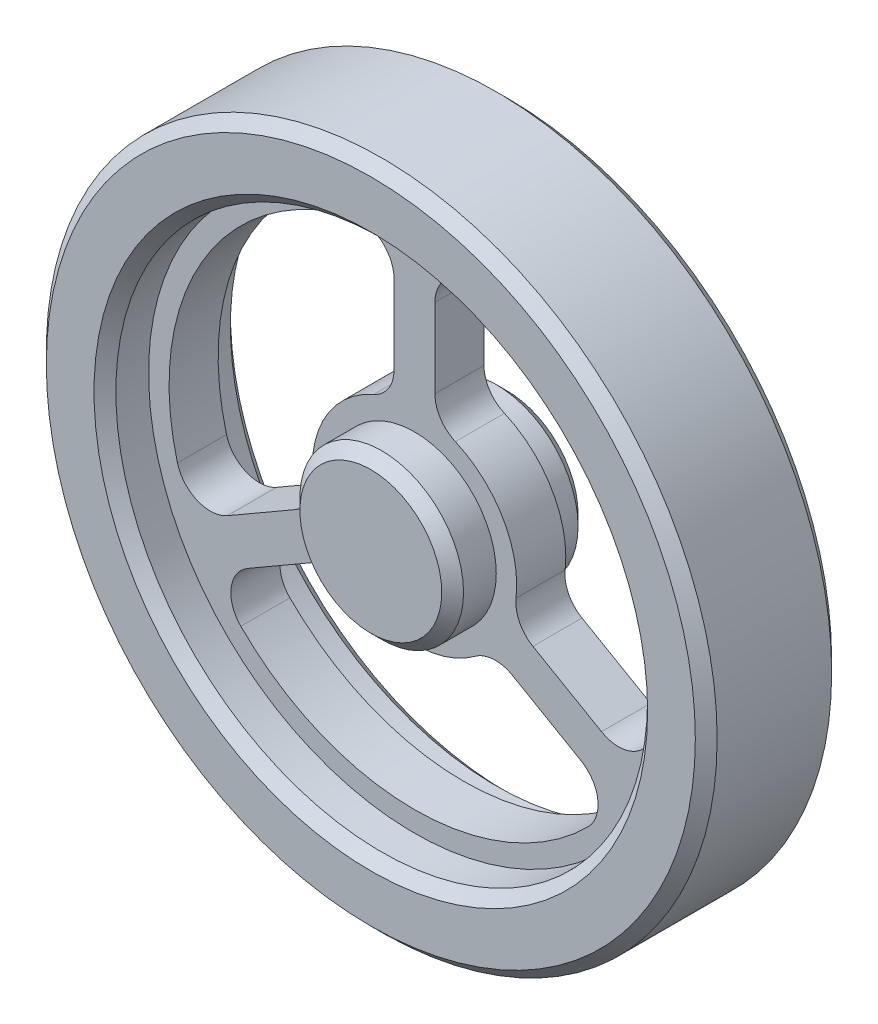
ISO-10303-21;
HEADER;
FILE_DESCRIPTION(('STEP AP214'),'2;1');
FILE_NAME('part.step','',(''),(''),'','','');
FILE_SCHEMA(('AUTOMOTIVE_DESIGN { 1 0 10303 214 1 1 1 1 }'));
ENDSEC;
DATA;
#1=APPLICATION_CONTEXT('core data for automotive mechanical design processes');
#2=APPLICATION_PROTOCOL_DEFINITION('international standard','automotive_design',2000,#1);
#3=PRODUCT_CONTEXT('',#1,'mechanical');
#4=PRODUCT('Part','Part','',(#3));
#5=PRODUCT_RELATED_PRODUCT_CATEGORY('part','',(#4));
#6=PRODUCT_DEFINITION_FORMATION('','',#4);
#7=PRODUCT_DEFINITION_CONTEXT('part definition',#1,'design');
#8=PRODUCT_DEFINITION('design','',#6,#7);
#9=PRODUCT_DEFINITION_SHAPE('','',#8);
#10=(LENGTH_UNIT() NAMED_UNIT(*) SI_UNIT(.MILLI.,.METRE.));
#11=(NAMED_UNIT(*) PLANE_ANGLE_UNIT() SI_UNIT($,.RADIAN.));
#12=(NAMED_UNIT(*) SI_UNIT($,.STERADIAN.) SOLID_ANGLE_UNIT());
#13=UNCERTAINTY_MEASURE_WITH_UNIT(LENGTH_MEASURE(1.E-05),#10,'distance_accuracy_value','');
#14=(GEOMETRIC_REPRESENTATION_CONTEXT(3) GLOBAL_UNCERTAINTY_ASSIGNED_CONTEXT((#13)) GLOBAL_UNIT_ASSIGNED_CONTEXT((#10,
#11,#12)) REPRESENTATION_CONTEXT('',''));
#15=CARTESIAN_POINT('',(0.,0.,0.));
#16=DIRECTION('',(0.,0.,1.));
#17=DIRECTION('',(1.,0.,0.));
#18=AXIS2_PLACEMENT_3D('',#15,#16,#17);
#19=CARTESIAN_POINT('',(0.,0.,-5.));
#20=DIRECTION('',(0.,0.,1.));
#21=DIRECTION('',(1.,0.,0.));
#22=AXIS2_PLACEMENT_3D('',#19,#20,#21);
#23=PLANE('',#22);
#24=CARTESIAN_POINT('',(0.,0.,-5.));
#25=DIRECTION('',(0.,0.,1.));
#26=DIRECTION('',(1.,0.,0.));
#27=AXIS2_PLACEMENT_3D('',#24,#25,#26);
#28=CIRCLE('',#27,5.2);
#29=CARTESIAN_POINT('',(5.2,0.,-5.));
#30=VERTEX_POINT('',#29);
#31=EDGE_CURVE('E410',#30,#30,#28,.F.);
#32=ORIENTED_EDGE('',*,*,#31,.T.);
#33=EDGE_LOOP('',(#32));
#34=FACE_BOUND('',#33,.T.);
#35=CARTESIAN_POINT('',(0.,0.,-5.));
#36=DIRECTION('',(0.,0.,1.));
#37=DIRECTION('',(1.,0.,0.));
#38=AXIS2_PLACEMENT_3D('',#35,#36,#37);
#39=CIRCLE('',#38,3.);
#40=CARTESIAN_POINT('',(3.,0.,-5.));
#41=VERTEX_POINT('',#40);
#42=EDGE_CURVE('E404',#41,#41,#39,.F.);
#43=ORIENTED_EDGE('',*,*,#42,.F.);
#44=EDGE_LOOP('',(#43));
#45=FACE_BOUND('',#44,.T.);
#46=ADVANCED_FACE('F48',(#34,#45),#23,.F.);
#47=CARTESIAN_POINT('',(0.,0.,-5.));
#48=DIRECTION('',(0.,0.,1.));
#49=DIRECTION('',(1.,0.,0.));
#50=AXIS2_PLACEMENT_3D('',#47,#48,#49);
#51=CYLINDRICAL_SURFACE('',#50,18.);
#52=CARTESIAN_POINT('',(0.,0.,1.8));
#53=DIRECTION('',(0.,0.,1.));
#54=DIRECTION('',(1.,0.,0.));
#55=AXIS2_PLACEMENT_3D('',#52,#53,#54);
#56=CIRCLE('',#55,18.);
#57=CARTESIAN_POINT('',(-4.64516129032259,17.39029834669,1.8));
#58=VERTEX_POINT('',#57);
#59=CARTESIAN_POINT('',(-17.3830207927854,-4.67232149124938,1.8));
#60=VERTEX_POINT('',#59);
#61=EDGE_CURVE('E292',#58,#60,#56,.T.);
#62=ORIENTED_EDGE('',*,*,#61,.T.);
#63=DIRECTION('',(0.,0.,1.));
#64=VECTOR('',#63,1.);
#65=CARTESIAN_POINT('',(-17.3830207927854,-4.67232149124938,-5.));
#66=LINE('',#65,#64);
#67=CARTESIAN_POINT('',(-17.3830207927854,-4.67232149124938,-1.8));
#68=VERTEX_POINT('',#67);
#69=EDGE_CURVE('E63',#60,#68,#66,.F.);
#70=ORIENTED_EDGE('',*,*,#69,.T.);
#71=CARTESIAN_POINT('',(0.,0.,-1.8));
#72=DIRECTION('',(0.,0.,-1.));
#73=DIRECTION('',(-1.,0.,0.));
#74=AXIS2_PLACEMENT_3D('',#71,#72,#73);
#75=CIRCLE('',#74,18.);
#76=CARTESIAN_POINT('',(-4.64516129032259,17.39029834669,-1.8));
#77=VERTEX_POINT('',#76);
#78=EDGE_CURVE('E285',#68,#77,#75,.T.);
#79=ORIENTED_EDGE('',*,*,#78,.T.);
#80=DIRECTION('',(0.,0.,1.));
#81=VECTOR('',#80,1.);
#82=CARTESIAN_POINT('',(-4.64516129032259,17.39029834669,-5.));
#83=LINE('',#82,#81);
#84=EDGE_CURVE('E312',#77,#58,#83,.T.);
#85=ORIENTED_EDGE('',*,*,#84,.T.);
#86=EDGE_LOOP('',(#62,#70,#79,#85));
#87=FACE_BOUND('',#86,.T.);
#88=ADVANCED_FACE('F451',(#87),#51,.F.);
#89=CARTESIAN_POINT('',(0.,0.,-5.));
#90=DIRECTION('',(0.,0.,1.));
#91=DIRECTION('',(1.,0.,0.));
#92=AXIS2_PLACEMENT_3D('',#89,#90,#91);
#93=CYLINDRICAL_SURFACE('',#92,7.5);
#94=CARTESIAN_POINT('',(0.,0.,-1.8));
#95=DIRECTION('',(0.,0.,-1.));
#96=DIRECTION('',(-1.,0.,0.));
#97=AXIS2_PLACEMENT_3D('',#94,#95,#96);
#98=CIRCLE('',#97,7.5);
#99=CARTESIAN_POINT('',(-7.45294044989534,-0.838855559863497,-1.8));
#100=VERTEX_POINT('',#99);
#101=CARTESIAN_POINT('',(-3.,6.87386354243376,-1.8));
#102=VERTEX_POINT('',#101);
#103=EDGE_CURVE('E251',#100,#102,#98,.T.);
#104=ORIENTED_EDGE('',*,*,#103,.F.);
#105=DIRECTION('',(0.,0.,1.));
#106=VECTOR('',#105,1.);
#107=CARTESIAN_POINT('',(-7.45294044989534,-0.838855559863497,-5.));
#108=LINE('',#107,#106);
#109=CARTESIAN_POINT('',(-7.45294044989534,-0.838855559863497,1.8));
#110=VERTEX_POINT('',#109);
#111=EDGE_CURVE('E370',#100,#110,#108,.T.);
#112=ORIENTED_EDGE('',*,*,#111,.T.);
#113=CARTESIAN_POINT('',(0.,0.,1.8));
#114=DIRECTION('',(0.,0.,1.));
#115=DIRECTION('',(1.,0.,0.));
#116=AXIS2_PLACEMENT_3D('',#113,#114,#115);
#117=CIRCLE('',#116,7.5);
#118=CARTESIAN_POINT('',(-3.,6.87386354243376,1.8));
#119=VERTEX_POINT('',#118);
#120=EDGE_CURVE('E252',#119,#110,#117,.T.);
#121=ORIENTED_EDGE('',*,*,#120,.F.);
#122=DIRECTION('',(0.,0.,1.));
#123=VECTOR('',#122,1.);
#124=CARTESIAN_POINT('',(-3.,6.87386354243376,-5.));
#125=LINE('',#124,#123);
#126=EDGE_CURVE('E283',#119,#102,#125,.F.);
#127=ORIENTED_EDGE('',*,*,#126,.T.);
#128=EDGE_LOOP('',(#104,#112,#121,#127));
#129=FACE_BOUND('',#128,.T.);
#130=ADVANCED_FACE('F457',(#129),#93,.T.);
#131=CARTESIAN_POINT('',(12.7378595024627,-12.7179768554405,-1.8));
#132=VERTEX_POINT('',#131);
#133=CARTESIAN_POINT('',(-12.7378595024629,-12.7179768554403,-1.8));
#134=VERTEX_POINT('',#133);
#135=EDGE_CURVE('E284',#132,#134,#75,.T.);
#136=ORIENTED_EDGE('',*,*,#135,.T.);
#137=DIRECTION('',(0.,0.,1.));
#138=VECTOR('',#137,1.);
#139=CARTESIAN_POINT('',(-12.7378595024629,-12.7179768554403,-5.));
#140=LINE('',#139,#138);
#141=CARTESIAN_POINT('',(-12.7378595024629,-12.7179768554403,1.8));
#142=VERTEX_POINT('',#141);
#143=EDGE_CURVE('E385',#134,#142,#140,.T.);
#144=ORIENTED_EDGE('',*,*,#143,.T.);
#145=CARTESIAN_POINT('',(12.7378595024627,-12.7179768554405,1.8));
#146=VERTEX_POINT('',#145);
#147=EDGE_CURVE('E294',#142,#146,#56,.T.);
#148=ORIENTED_EDGE('',*,*,#147,.T.);
#149=DIRECTION('',(0.,0.,1.));
#150=VECTOR('',#149,1.);
#151=CARTESIAN_POINT('',(12.7378595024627,-12.7179768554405,-5.));
#152=LINE('',#151,#150);
#153=EDGE_CURVE('E351',#146,#132,#152,.F.);
#154=ORIENTED_EDGE('',*,*,#153,.T.);
#155=EDGE_LOOP('',(#136,#144,#148,#154));
#156=FACE_BOUND('',#155,.T.);
#157=ADVANCED_FACE('F459',(#156),#51,.F.);
#158=CARTESIAN_POINT('',(-4.45294044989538,-6.03500798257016,1.8));
#159=VERTEX_POINT('',#158);
#160=CARTESIAN_POINT('',(4.4529404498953,-6.03500798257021,1.8));
#161=VERTEX_POINT('',#160);
#162=EDGE_CURVE('E256',#159,#161,#117,.T.);
#163=ORIENTED_EDGE('',*,*,#162,.F.);
#164=DIRECTION('',(0.,0.,1.));
#165=VECTOR('',#164,1.);
#166=CARTESIAN_POINT('',(-4.45294044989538,-6.03500798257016,-5.));
#167=LINE('',#166,#165);
#168=CARTESIAN_POINT('',(-4.45294044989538,-6.03500798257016,-1.8));
#169=VERTEX_POINT('',#168);
#170=EDGE_CURVE('E383',#159,#169,#167,.F.);
#171=ORIENTED_EDGE('',*,*,#170,.T.);
#172=CARTESIAN_POINT('',(4.4529404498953,-6.03500798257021,-1.8));
#173=VERTEX_POINT('',#172);
#174=EDGE_CURVE('E267',#173,#169,#98,.T.);
#175=ORIENTED_EDGE('',*,*,#174,.F.);
#176=DIRECTION('',(0.,0.,1.));
#177=VECTOR('',#176,1.);
#178=CARTESIAN_POINT('',(4.4529404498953,-6.03500798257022,-5.));
#179=LINE('',#178,#177);
#180=EDGE_CURVE('E333',#173,#161,#179,.T.);
#181=ORIENTED_EDGE('',*,*,#180,.T.);
#182=EDGE_LOOP('',(#163,#171,#175,#181));
#183=FACE_BOUND('',#182,.T.);
#184=ADVANCED_FACE('F494',(#183),#93,.T.);
#185=CARTESIAN_POINT('',(0.,0.,-5.));
#186=DIRECTION('',(0.,0.,1.));
#187=DIRECTION('',(1.,0.,0.));
#188=AXIS2_PLACEMENT_3D('',#185,#186,#187);
#189=PLANE('',#188);
#190=CARTESIAN_POINT('',(0.,0.,-5.));
#191=DIRECTION('',(0.,0.,1.));
#192=DIRECTION('',(1.,0.,0.));
#193=AXIS2_PLACEMENT_3D('',#190,#191,#192);
#194=CIRCLE('',#193,23.8);
#195=CARTESIAN_POINT('',(23.8,0.,-5.));
#196=VERTEX_POINT('',#195);
#197=EDGE_CURVE('E428',#196,#196,#194,.F.);
#198=ORIENTED_EDGE('',*,*,#197,.T.);
#199=EDGE_LOOP('',(#198));
#200=FACE_BOUND('',#199,.T.);
#201=CARTESIAN_POINT('',(0.,0.,-5.));
#202=DIRECTION('',(0.,0.,1.));
#203=DIRECTION('',(1.,0.,0.));
#204=AXIS2_PLACEMENT_3D('',#201,#202,#203);
#205=CIRCLE('',#204,20.3);
#206=CARTESIAN_POINT('',(20.3,0.,-5.));
#207=VERTEX_POINT('',#206);
#208=EDGE_CURVE('E425',#207,#207,#205,.T.);
#209=ORIENTED_EDGE('',*,*,#208,.T.);
#210=EDGE_LOOP('',(#209));
#211=FACE_BOUND('',#210,.T.);
#212=ADVANCED_FACE('F478',(#200,#211),#189,.F.);
#213=CARTESIAN_POINT('',(0.,0.,5.));
#214=DIRECTION('',(0.,0.,-1.));
#215=DIRECTION('',(-1.,0.,0.));
#216=AXIS2_PLACEMENT_3D('',#213,#214,#215);
#217=CYLINDRICAL_SURFACE('',#216,24.6);
#218=CARTESIAN_POINT('',(0.,0.,-4.20000000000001));
#219=DIRECTION('',(0.,0.,1.));
#220=DIRECTION('',(1.,0.,0.));
#221=AXIS2_PLACEMENT_3D('',#218,#219,#220);
#222=CIRCLE('',#221,24.6);
#223=CARTESIAN_POINT('',(24.6,0.,-4.20000000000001));
#224=VERTEX_POINT('',#223);
#225=EDGE_CURVE('E422',#224,#224,#222,.T.);
#226=ORIENTED_EDGE('',*,*,#225,.T.);
#227=EDGE_LOOP('',(#226));
#228=FACE_BOUND('',#227,.T.);
#229=CARTESIAN_POINT('',(0.,0.,4.20000000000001));
#230=DIRECTION('',(0.,0.,1.));
#231=DIRECTION('',(1.,0.,0.));
#232=AXIS2_PLACEMENT_3D('',#229,#230,#231);
#233=CIRCLE('',#232,24.6);
#234=CARTESIAN_POINT('',(24.6,0.,4.20000000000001));
#235=VERTEX_POINT('',#234);
#236=EDGE_CURVE('E419',#235,#235,#233,.F.);
#237=ORIENTED_EDGE('',*,*,#236,.T.);
#238=EDGE_LOOP('',(#237));
#239=FACE_BOUND('',#238,.T.);
#240=ADVANCED_FACE('F475',(#228,#239),#217,.T.);
#241=CARTESIAN_POINT('',(0.,0.,5.));
#242=DIRECTION('',(0.,0.,1.));
#243=DIRECTION('',(1.,0.,0.));
#244=AXIS2_PLACEMENT_3D('',#241,#242,#243);
#245=PLANE('',#244);
#246=CARTESIAN_POINT('',(0.,0.,5.));
#247=DIRECTION('',(0.,0.,1.));
#248=DIRECTION('',(1.,0.,0.));
#249=AXIS2_PLACEMENT_3D('',#246,#247,#248);
#250=CIRCLE('',#249,20.3);
#251=CARTESIAN_POINT('',(20.3,0.,5.));
#252=VERTEX_POINT('',#251);
#253=EDGE_CURVE('E12',#252,#252,#250,.F.);
#254=ORIENTED_EDGE('',*,*,#253,.T.);
#255=EDGE_LOOP('',(#254));
#256=FACE_BOUND('',#255,.T.);
#257=CARTESIAN_POINT('',(0.,0.,5.));
#258=DIRECTION('',(0.,0.,1.));
#259=DIRECTION('',(1.,0.,0.));
#260=AXIS2_PLACEMENT_3D('',#257,#258,#259);
#261=CIRCLE('',#260,23.8);
#262=CARTESIAN_POINT('',(23.8,0.,5.));
#263=VERTEX_POINT('',#262);
#264=EDGE_CURVE('E56',#263,#263,#261,.T.);
#265=ORIENTED_EDGE('',*,*,#264,.T.);
#266=EDGE_LOOP('',(#265));
#267=FACE_BOUND('',#266,.T.);
#268=ADVANCED_FACE('F439',(#256,#267),#245,.T.);
#269=CARTESIAN_POINT('',(0.,0.,1.8));
#270=DIRECTION('',(0.,0.,1.));
#271=DIRECTION('',(1.,0.,0.));
#272=AXIS2_PLACEMENT_3D('',#269,#270,#271);
#273=CYLINDRICAL_SURFACE('',#272,19.5);
#274=CARTESIAN_POINT('',(0.,0.,4.2));
#275=DIRECTION('',(0.,0.,1.));
#276=DIRECTION('',(1.,0.,0.));
#277=AXIS2_PLACEMENT_3D('',#274,#275,#276);
#278=CIRCLE('',#277,19.5);
#279=CARTESIAN_POINT('',(19.5,0.,4.2));
#280=VERTEX_POINT('',#279);
#281=EDGE_CURVE('E434',#280,#280,#278,.T.);
#282=ORIENTED_EDGE('',*,*,#281,.T.);
#283=EDGE_LOOP('',(#282));
#284=FACE_BOUND('',#283,.T.);
#285=CARTESIAN_POINT('',(0.,0.,1.8));
#286=DIRECTION('',(0.,0.,1.));
#287=DIRECTION('',(1.,0.,0.));
#288=AXIS2_PLACEMENT_3D('',#285,#286,#287);
#289=CIRCLE('',#288,19.5);
#290=CARTESIAN_POINT('',(19.5,0.,1.8));
#291=VERTEX_POINT('',#290);
#292=EDGE_CURVE('E279',#291,#291,#289,.T.);
#293=ORIENTED_EDGE('',*,*,#292,.F.);
#294=EDGE_LOOP('',(#293));
#295=FACE_BOUND('',#294,.T.);
#296=ADVANCED_FACE('F480',(#284,#295),#273,.F.);
#297=CARTESIAN_POINT('',(0.,0.,1.8));
#298=DIRECTION('',(0.,0.,1.));
#299=DIRECTION('',(1.,0.,0.));
#300=AXIS2_PLACEMENT_3D('',#297,#298,#299);
#301=PLANE('',#300);
#302=ORIENTED_EDGE('',*,*,#147,.F.);
#303=CARTESIAN_POINT('',(-10.968712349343,-10.9515911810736,1.8));
#304=DIRECTION('',(0.,0.,1.));
#305=DIRECTION('',(1.,0.,0.));
#306=AXIS2_PLACEMENT_3D('',#303,#304,#305);
#307=CIRCLE('',#306,2.5);
#308=CARTESIAN_POINT('',(-12.218712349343,-8.78652767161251,1.8));
#309=VERTEX_POINT('',#308);
#310=EDGE_CURVE('E397',#142,#309,#307,.F.);
#311=ORIENTED_EDGE('',*,*,#310,.T.);
#312=DIRECTION('',(0.866025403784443,0.499999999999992,0.));
#313=VECTOR('',#312,1.);
#314=CARTESIAN_POINT('',(-5.61396103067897,-4.97327271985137,1.8));
#315=LINE('',#314,#313);
#316=CARTESIAN_POINT('',(-7.18725393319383,-5.88161380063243,1.8));
#317=VERTEX_POINT('',#316);
#318=EDGE_CURVE('E229',#309,#317,#315,.T.);
#319=ORIENTED_EDGE('',*,*,#318,.T.);
#320=CARTESIAN_POINT('',(-5.93725393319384,-8.04667731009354,1.8));
#321=DIRECTION('',(0.,0.,1.));
#322=DIRECTION('',(1.,0.,0.));
#323=AXIS2_PLACEMENT_3D('',#320,#321,#322);
#324=CIRCLE('',#323,2.5);
#325=EDGE_CURVE('E393',#317,#159,#324,.F.);
#326=ORIENTED_EDGE('',*,*,#325,.T.);
#327=ORIENTED_EDGE('',*,*,#162,.T.);
#328=CARTESIAN_POINT('',(5.93725393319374,-8.04667731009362,1.8));
#329=DIRECTION('',(0.,0.,1.));
#330=DIRECTION('',(1.,0.,0.));
#331=AXIS2_PLACEMENT_3D('',#328,#329,#330);
#332=CIRCLE('',#331,2.5);
#333=CARTESIAN_POINT('',(7.18725393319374,-5.88161380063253,1.8));
#334=VERTEX_POINT('',#333);
#335=EDGE_CURVE('E353',#161,#334,#332,.F.);
#336=ORIENTED_EDGE('',*,*,#335,.T.);
#337=DIRECTION('',(0.866025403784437,-0.500000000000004,0.));
#338=VECTOR('',#337,1.);
#339=CARTESIAN_POINT('',(14.7842363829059,-10.2677336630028,1.8));
#340=LINE('',#339,#338);
#341=CARTESIAN_POINT('',(12.2187123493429,-8.78652767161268,1.8));
#342=VERTEX_POINT('',#341);
#343=EDGE_CURVE('E239',#334,#342,#340,.T.);
#344=ORIENTED_EDGE('',*,*,#343,.T.);
#345=CARTESIAN_POINT('',(10.9687123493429,-10.9515911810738,1.8));
#346=DIRECTION('',(0.,0.,1.));
#347=DIRECTION('',(1.,0.,0.));
#348=AXIS2_PLACEMENT_3D('',#345,#346,#347);
#349=CIRCLE('',#348,2.5);
#350=EDGE_CURVE('E365',#342,#146,#349,.F.);
#351=ORIENTED_EDGE('',*,*,#350,.T.);
#352=EDGE_LOOP('',(#302,#311,#319,#326,#327,#336,#344,#351));
#353=FACE_BOUND('',#352,.T.);
#354=CARTESIAN_POINT('',(17.3830207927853,-4.67232149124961,1.8));
#355=VERTEX_POINT('',#354);
#356=CARTESIAN_POINT('',(4.64516129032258,17.39029834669,1.8));
#357=VERTEX_POINT('',#356);
#358=EDGE_CURVE('E291',#355,#357,#56,.T.);
#359=ORIENTED_EDGE('',*,*,#358,.F.);
#360=CARTESIAN_POINT('',(14.9687123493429,-4.02338795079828,1.8));
#361=DIRECTION('',(0.,0.,1.));
#362=DIRECTION('',(1.,0.,0.));
#363=AXIS2_PLACEMENT_3D('',#360,#361,#362);
#364=CIRCLE('',#363,2.5);
#365=CARTESIAN_POINT('',(13.7187123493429,-6.18845146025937,1.8));
#366=VERTEX_POINT('',#365);
#367=EDGE_CURVE('E361',#355,#366,#364,.F.);
#368=ORIENTED_EDGE('',*,*,#367,.T.);
#369=DIRECTION('',(-0.866025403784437,0.500000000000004,0.));
#370=VECTOR('',#369,1.);
#371=CARTESIAN_POINT('',(7.11396103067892,-2.37519650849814,1.8));
#372=LINE('',#371,#370);
#373=CARTESIAN_POINT('',(8.68725393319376,-3.28353758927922,1.8));
#374=VERTEX_POINT('',#373);
#375=EDGE_CURVE('E240',#366,#374,#372,.T.);
#376=ORIENTED_EDGE('',*,*,#375,.T.);
#377=CARTESIAN_POINT('',(9.93725393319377,-1.11847407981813,1.8));
#378=DIRECTION('',(0.,0.,1.));
#379=DIRECTION('',(1.,0.,0.));
#380=AXIS2_PLACEMENT_3D('',#377,#378,#379);
#381=CIRCLE('',#380,2.5);
#382=CARTESIAN_POINT('',(7.45294044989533,-0.838855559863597,1.8));
#383=VERTEX_POINT('',#382);
#384=EDGE_CURVE('E357',#374,#383,#381,.F.);
#385=ORIENTED_EDGE('',*,*,#384,.T.);
#386=CARTESIAN_POINT('',(3.,6.87386354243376,1.8));
#387=VERTEX_POINT('',#386);
#388=EDGE_CURVE('E257',#383,#387,#117,.T.);
#389=ORIENTED_EDGE('',*,*,#388,.T.);
#390=CARTESIAN_POINT('',(4.,9.16515138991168,1.8));
#391=DIRECTION('',(0.,0.,1.));
#392=DIRECTION('',(1.,0.,0.));
#393=AXIS2_PLACEMENT_3D('',#390,#391,#392);
#394=CIRCLE('',#393,2.5);
#395=CARTESIAN_POINT('',(1.5,9.16515138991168,1.8));
#396=VERTEX_POINT('',#395);
#397=EDGE_CURVE('E315',#387,#396,#394,.F.);
#398=ORIENTED_EDGE('',*,*,#397,.T.);
#399=DIRECTION('',(0.,1.,0.));
#400=VECTOR('',#399,1.);
#401=CARTESIAN_POINT('',(1.5,17.9373911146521,1.8));
#402=LINE('',#401,#400);
#403=CARTESIAN_POINT('',(1.5,14.9749791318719,1.8));
#404=VERTEX_POINT('',#403);
#405=EDGE_CURVE('E263',#396,#404,#402,.T.);
#406=ORIENTED_EDGE('',*,*,#405,.T.);
#407=CARTESIAN_POINT('',(4.,14.9749791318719,1.8));
#408=DIRECTION('',(0.,0.,1.));
#409=DIRECTION('',(1.,0.,0.));
#410=AXIS2_PLACEMENT_3D('',#407,#408,#409);
#411=CIRCLE('',#410,2.5);
#412=EDGE_CURVE('E328',#404,#357,#411,.F.);
#413=ORIENTED_EDGE('',*,*,#412,.T.);
#414=EDGE_LOOP('',(#359,#368,#376,#385,#389,#398,#406,#413));
#415=FACE_BOUND('',#414,.T.);
#416=ORIENTED_EDGE('',*,*,#61,.F.);
#417=CARTESIAN_POINT('',(-4.,14.9749791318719,1.8));
#418=DIRECTION('',(0.,0.,1.));
#419=DIRECTION('',(1.,0.,0.));
#420=AXIS2_PLACEMENT_3D('',#417,#418,#419);
#421=CIRCLE('',#420,2.5);
#422=CARTESIAN_POINT('',(-1.5,14.9749791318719,1.8));
#423=VERTEX_POINT('',#422);
#424=EDGE_CURVE('E323',#58,#423,#421,.F.);
#425=ORIENTED_EDGE('',*,*,#424,.T.);
#426=DIRECTION('',(0.,-1.,0.));
#427=VECTOR('',#426,1.);
#428=CARTESIAN_POINT('',(-1.5,7.34846922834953,1.8));
#429=LINE('',#428,#427);
#430=CARTESIAN_POINT('',(-1.5,9.16515138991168,1.8));
#431=VERTEX_POINT('',#430);
#432=EDGE_CURVE('E268',#423,#431,#429,.T.);
#433=ORIENTED_EDGE('',*,*,#432,.T.);
#434=CARTESIAN_POINT('',(-4.,9.16515138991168,1.8));
#435=DIRECTION('',(0.,0.,1.));
#436=DIRECTION('',(1.,0.,0.));
#437=AXIS2_PLACEMENT_3D('',#434,#435,#436);
#438=CIRCLE('',#437,2.5);
#439=EDGE_CURVE('E319',#431,#119,#438,.F.);
#440=ORIENTED_EDGE('',*,*,#439,.T.);
#441=ORIENTED_EDGE('',*,*,#120,.T.);
#442=CARTESIAN_POINT('',(-9.93725393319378,-1.118474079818,1.8));
#443=DIRECTION('',(0.,0.,1.));
#444=DIRECTION('',(1.,0.,0.));
#445=AXIS2_PLACEMENT_3D('',#442,#443,#444);
#446=CIRCLE('',#445,2.5);
#447=CARTESIAN_POINT('',(-8.68725393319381,-3.28353758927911,1.8));
#448=VERTEX_POINT('',#447);
#449=EDGE_CURVE('E389',#110,#448,#446,.F.);
#450=ORIENTED_EDGE('',*,*,#449,.T.);
#451=DIRECTION('',(-0.866025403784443,-0.499999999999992,0.));
#452=VECTOR('',#451,1.);
#453=CARTESIAN_POINT('',(-16.2842363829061,-7.66965745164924,1.8));
#454=LINE('',#453,#452);
#455=CARTESIAN_POINT('',(-13.718712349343,-6.18845146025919,1.8));
#456=VERTEX_POINT('',#455);
#457=EDGE_CURVE('E224',#448,#456,#454,.T.);
#458=ORIENTED_EDGE('',*,*,#457,.T.);
#459=CARTESIAN_POINT('',(-14.968712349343,-4.02338795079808,1.8));
#460=DIRECTION('',(0.,0.,1.));
#461=DIRECTION('',(1.,0.,0.));
#462=AXIS2_PLACEMENT_3D('',#459,#460,#461);
#463=CIRCLE('',#462,2.5);
#464=EDGE_CURVE('E71',#456,#60,#463,.F.);
#465=ORIENTED_EDGE('',*,*,#464,.T.);
#466=EDGE_LOOP('',(#416,#425,#433,#440,#441,#450,#458,#465));
#467=FACE_BOUND('',#466,.T.);
#468=ORIENTED_EDGE('',*,*,#292,.T.);
#469=EDGE_LOOP('',(#468));
#470=FACE_BOUND('',#469,.T.);
#471=CARTESIAN_POINT('',(0.,0.,1.8));
#472=DIRECTION('',(0.,0.,1.));
#473=DIRECTION('',(1.,0.,0.));
#474=AXIS2_PLACEMENT_3D('',#471,#472,#473);
#475=CIRCLE('',#474,6.);
#476=CARTESIAN_POINT('',(6.,0.,1.8));
#477=VERTEX_POINT('',#476);
#478=EDGE_CURVE('E260',#477,#477,#475,.T.);
#479=ORIENTED_EDGE('',*,*,#478,.F.);
#480=EDGE_LOOP('',(#479));
#481=FACE_BOUND('',#480,.T.);
#482=ADVANCED_FACE('F483',(#353,#415,#467,#470,#481),#301,.T.);
#483=CARTESIAN_POINT('',(0.,0.,-1.8));
#484=DIRECTION('',(0.,0.,-1.));
#485=DIRECTION('',(1.,0.,0.));
#486=AXIS2_PLACEMENT_3D('',#483,#484,#485);
#487=PLANE('',#486);
#488=DIRECTION('',(0.866025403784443,0.499999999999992,0.));
#489=VECTOR('',#488,1.);
#490=CARTESIAN_POINT('',(-5.61396103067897,-4.97327271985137,-1.8));
#491=LINE('',#490,#489);
#492=CARTESIAN_POINT('',(-12.218712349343,-8.78652767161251,-1.8));
#493=VERTEX_POINT('',#492);
#494=CARTESIAN_POINT('',(-7.18725393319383,-5.88161380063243,-1.8));
#495=VERTEX_POINT('',#494);
#496=EDGE_CURVE('E236',#493,#495,#491,.T.);
#497=ORIENTED_EDGE('',*,*,#496,.F.);
#498=CARTESIAN_POINT('',(-10.968712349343,-10.9515911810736,-1.8));
#499=DIRECTION('',(0.,0.,-1.));
#500=DIRECTION('',(-1.,0.,0.));
#501=AXIS2_PLACEMENT_3D('',#498,#499,#500);
#502=CIRCLE('',#501,2.5);
#503=EDGE_CURVE('E399',#493,#134,#502,.F.);
#504=ORIENTED_EDGE('',*,*,#503,.T.);
#505=ORIENTED_EDGE('',*,*,#135,.F.);
#506=CARTESIAN_POINT('',(10.9687123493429,-10.9515911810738,-1.8));
#507=DIRECTION('',(0.,0.,-1.));
#508=DIRECTION('',(-1.,0.,0.));
#509=AXIS2_PLACEMENT_3D('',#506,#507,#508);
#510=CIRCLE('',#509,2.5);
#511=CARTESIAN_POINT('',(12.2187123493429,-8.78652767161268,-1.8));
#512=VERTEX_POINT('',#511);
#513=EDGE_CURVE('E368',#132,#512,#510,.F.);
#514=ORIENTED_EDGE('',*,*,#513,.T.);
#515=DIRECTION('',(0.866025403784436,-0.500000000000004,0.));
#516=VECTOR('',#515,1.);
#517=CARTESIAN_POINT('',(14.7842363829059,-10.2677336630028,-1.8));
#518=LINE('',#517,#516);
#519=CARTESIAN_POINT('',(7.18725393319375,-5.88161380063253,-1.8));
#520=VERTEX_POINT('',#519);
#521=EDGE_CURVE('E243',#520,#512,#518,.T.);
#522=ORIENTED_EDGE('',*,*,#521,.F.);
#523=CARTESIAN_POINT('',(5.93725393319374,-8.04667731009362,-1.8));
#524=DIRECTION('',(0.,0.,-1.));
#525=DIRECTION('',(-1.,0.,0.));
#526=AXIS2_PLACEMENT_3D('',#523,#524,#525);
#527=CIRCLE('',#526,2.5);
#528=EDGE_CURVE('E355',#520,#173,#527,.F.);
#529=ORIENTED_EDGE('',*,*,#528,.T.);
#530=ORIENTED_EDGE('',*,*,#174,.T.);
#531=CARTESIAN_POINT('',(-5.93725393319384,-8.04667731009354,-1.8));
#532=DIRECTION('',(0.,0.,-1.));
#533=DIRECTION('',(-1.,0.,0.));
#534=AXIS2_PLACEMENT_3D('',#531,#532,#533);
#535=CIRCLE('',#534,2.5);
#536=EDGE_CURVE('E395',#169,#495,#535,.F.);
#537=ORIENTED_EDGE('',*,*,#536,.T.);
#538=EDGE_LOOP('',(#497,#504,#505,#514,#522,#529,#530,#537));
#539=FACE_BOUND('',#538,.T.);
#540=DIRECTION('',(-0.866025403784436,0.500000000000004,0.));
#541=VECTOR('',#540,1.);
#542=CARTESIAN_POINT('',(7.11396103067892,-2.37519650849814,-1.8));
#543=LINE('',#542,#541);
#544=CARTESIAN_POINT('',(13.7187123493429,-6.18845146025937,-1.8));
#545=VERTEX_POINT('',#544);
#546=CARTESIAN_POINT('',(8.68725393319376,-3.28353758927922,-1.8));
#547=VERTEX_POINT('',#546);
#548=EDGE_CURVE('E248',#545,#547,#543,.T.);
#549=ORIENTED_EDGE('',*,*,#548,.F.);
#550=CARTESIAN_POINT('',(14.9687123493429,-4.02338795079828,-1.8));
#551=DIRECTION('',(0.,0.,-1.));
#552=DIRECTION('',(-1.,0.,0.));
#553=AXIS2_PLACEMENT_3D('',#550,#551,#552);
#554=CIRCLE('',#553,2.5);
#555=CARTESIAN_POINT('',(17.3830207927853,-4.67232149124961,-1.8));
#556=VERTEX_POINT('',#555);
#557=EDGE_CURVE('E363',#545,#556,#554,.F.);
#558=ORIENTED_EDGE('',*,*,#557,.T.);
#559=CARTESIAN_POINT('',(4.64516129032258,17.39029834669,-1.8));
#560=VERTEX_POINT('',#559);
#561=EDGE_CURVE('E280',#560,#556,#75,.T.);
#562=ORIENTED_EDGE('',*,*,#561,.F.);
#563=CARTESIAN_POINT('',(4.,14.9749791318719,-1.8));
#564=DIRECTION('',(0.,0.,-1.));
#565=DIRECTION('',(-1.,0.,0.));
#566=AXIS2_PLACEMENT_3D('',#563,#564,#565);
#567=CIRCLE('',#566,2.5);
#568=CARTESIAN_POINT('',(1.5,14.9749791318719,-1.8));
#569=VERTEX_POINT('',#568);
#570=EDGE_CURVE('E331',#560,#569,#567,.F.);
#571=ORIENTED_EDGE('',*,*,#570,.T.);
#572=DIRECTION('',(0.,1.,0.));
#573=VECTOR('',#572,1.);
#574=CARTESIAN_POINT('',(1.5,17.9373911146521,-1.8));
#575=LINE('',#574,#573);
#576=CARTESIAN_POINT('',(1.5,9.16515138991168,-1.8));
#577=VERTEX_POINT('',#576);
#578=EDGE_CURVE('E271',#577,#569,#575,.T.);
#579=ORIENTED_EDGE('',*,*,#578,.F.);
#580=CARTESIAN_POINT('',(4.,9.16515138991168,-1.8));
#581=DIRECTION('',(0.,0.,-1.));
#582=DIRECTION('',(-1.,0.,0.));
#583=AXIS2_PLACEMENT_3D('',#580,#581,#582);
#584=CIRCLE('',#583,2.5);
#585=CARTESIAN_POINT('',(3.,6.87386354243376,-1.8));
#586=VERTEX_POINT('',#585);
#587=EDGE_CURVE('E317',#577,#586,#584,.F.);
#588=ORIENTED_EDGE('',*,*,#587,.T.);
#589=CARTESIAN_POINT('',(7.45294044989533,-0.838855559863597,-1.8));
#590=VERTEX_POINT('',#589);
#591=EDGE_CURVE('E264',#586,#590,#98,.T.);
#592=ORIENTED_EDGE('',*,*,#591,.T.);
#593=CARTESIAN_POINT('',(9.93725393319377,-1.11847407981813,-1.8));
#594=DIRECTION('',(0.,0.,-1.));
#595=DIRECTION('',(-1.,0.,0.));
#596=AXIS2_PLACEMENT_3D('',#593,#594,#595);
#597=CIRCLE('',#596,2.5);
#598=EDGE_CURVE('E359',#590,#547,#597,.F.);
#599=ORIENTED_EDGE('',*,*,#598,.T.);
#600=EDGE_LOOP('',(#549,#558,#562,#571,#579,#588,#592,#599));
#601=FACE_BOUND('',#600,.T.);
#602=ORIENTED_EDGE('',*,*,#78,.F.);
#603=CARTESIAN_POINT('',(-14.968712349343,-4.02338795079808,-1.8));
#604=DIRECTION('',(0.,0.,-1.));
#605=DIRECTION('',(-1.,0.,0.));
#606=AXIS2_PLACEMENT_3D('',#603,#604,#605);
#607=CIRCLE('',#606,2.5);
#608=CARTESIAN_POINT('',(-13.718712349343,-6.18845146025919,-1.8));
#609=VERTEX_POINT('',#608);
#610=EDGE_CURVE('E402',#68,#609,#607,.F.);
#611=ORIENTED_EDGE('',*,*,#610,.T.);
#612=DIRECTION('',(-0.866025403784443,-0.499999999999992,0.));
#613=VECTOR('',#612,1.);
#614=CARTESIAN_POINT('',(-16.2842363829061,-7.66965745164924,-1.8));
#615=LINE('',#614,#613);
#616=CARTESIAN_POINT('',(-8.68725393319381,-3.28353758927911,-1.8));
#617=VERTEX_POINT('',#616);
#618=EDGE_CURVE('E232',#617,#609,#615,.T.);
#619=ORIENTED_EDGE('',*,*,#618,.F.);
#620=CARTESIAN_POINT('',(-9.93725393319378,-1.118474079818,-1.8));
#621=DIRECTION('',(0.,0.,-1.));
#622=DIRECTION('',(-1.,0.,0.));
#623=AXIS2_PLACEMENT_3D('',#620,#621,#622);
#624=CIRCLE('',#623,2.5);
#625=EDGE_CURVE('E391',#617,#100,#624,.F.);
#626=ORIENTED_EDGE('',*,*,#625,.T.);
#627=ORIENTED_EDGE('',*,*,#103,.T.);
#628=CARTESIAN_POINT('',(-4.,9.16515138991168,-1.8));
#629=DIRECTION('',(0.,0.,-1.));
#630=DIRECTION('',(-1.,0.,0.));
#631=AXIS2_PLACEMENT_3D('',#628,#629,#630);
#632=CIRCLE('',#631,2.5);
#633=CARTESIAN_POINT('',(-1.5,9.16515138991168,-1.8));
#634=VERTEX_POINT('',#633);
#635=EDGE_CURVE('E321',#102,#634,#632,.F.);
#636=ORIENTED_EDGE('',*,*,#635,.T.);
#637=DIRECTION('',(0.,-1.,0.));
#638=VECTOR('',#637,1.);
#639=CARTESIAN_POINT('',(-1.5,7.34846922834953,-1.8));
#640=LINE('',#639,#638);
#641=CARTESIAN_POINT('',(-1.5,14.9749791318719,-1.8));
#642=VERTEX_POINT('',#641);
#643=EDGE_CURVE('E276',#642,#634,#640,.T.);
#644=ORIENTED_EDGE('',*,*,#643,.F.);
#645=CARTESIAN_POINT('',(-4.,14.9749791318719,-1.8));
#646=DIRECTION('',(0.,0.,-1.));
#647=DIRECTION('',(-1.,0.,0.));
#648=AXIS2_PLACEMENT_3D('',#645,#646,#647);
#649=CIRCLE('',#648,2.5);
#650=EDGE_CURVE('E325',#642,#77,#649,.F.);
#651=ORIENTED_EDGE('',*,*,#650,.T.);
#652=EDGE_LOOP('',(#602,#611,#619,#626,#627,#636,#644,#651));
#653=FACE_BOUND('',#652,.T.);
#654=CARTESIAN_POINT('',(0.,0.,-1.8));
#655=DIRECTION('',(0.,0.,1.));
#656=DIRECTION('',(1.,0.,0.));
#657=AXIS2_PLACEMENT_3D('',#654,#655,#656);
#658=CIRCLE('',#657,19.5);
#659=CARTESIAN_POINT('',(19.5,0.,-1.8));
#660=VERTEX_POINT('',#659);
#661=EDGE_CURVE('E288',#660,#660,#658,.T.);
#662=ORIENTED_EDGE('',*,*,#661,.F.);
#663=EDGE_LOOP('',(#662));
#664=FACE_BOUND('',#663,.T.);
#665=CARTESIAN_POINT('',(0.,0.,-1.8));
#666=DIRECTION('',(0.,0.,1.));
#667=DIRECTION('',(1.,0.,0.));
#668=AXIS2_PLACEMENT_3D('',#665,#666,#667);
#669=CIRCLE('',#668,6.);
#670=CARTESIAN_POINT('',(6.,0.,-1.8));
#671=VERTEX_POINT('',#670);
#672=EDGE_CURVE('E255',#671,#671,#669,.T.);
#673=ORIENTED_EDGE('',*,*,#672,.T.);
#674=EDGE_LOOP('',(#673));
#675=FACE_BOUND('',#674,.T.);
#676=ADVANCED_FACE('F487',(#539,#601,#653,#664,#675),#487,.T.);
#677=CARTESIAN_POINT('',(0.,0.,-1.8));
#678=DIRECTION('',(0.,0.,-1.));
#679=DIRECTION('',(-1.,0.,0.));
#680=AXIS2_PLACEMENT_3D('',#677,#678,#679);
#681=CYLINDRICAL_SURFACE('',#680,19.5);
#682=CARTESIAN_POINT('',(0.,0.,-4.2));
#683=DIRECTION('',(0.,0.,1.));
#684=DIRECTION('',(1.,0.,0.));
#685=AXIS2_PLACEMENT_3D('',#682,#683,#684);
#686=CIRCLE('',#685,19.5);
#687=CARTESIAN_POINT('',(19.5,0.,-4.2));
#688=VERTEX_POINT('',#687);
#689=EDGE_CURVE('E431',#688,#688,#686,.F.);
#690=ORIENTED_EDGE('',*,*,#689,.T.);
#691=EDGE_LOOP('',(#690));
#692=FACE_BOUND('',#691,.T.);
#693=ORIENTED_EDGE('',*,*,#661,.T.);
#694=EDGE_LOOP('',(#693));
#695=FACE_BOUND('',#694,.T.);
#696=ADVANCED_FACE('F485',(#692,#695),#681,.F.);
#697=ORIENTED_EDGE('',*,*,#561,.T.);
#698=DIRECTION('',(0.,0.,1.));
#699=VECTOR('',#698,1.);
#700=CARTESIAN_POINT('',(17.3830207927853,-4.67232149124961,-5.));
#701=LINE('',#700,#699);
#702=EDGE_CURVE('E348',#556,#355,#701,.T.);
#703=ORIENTED_EDGE('',*,*,#702,.T.);
#704=ORIENTED_EDGE('',*,*,#358,.T.);
#705=DIRECTION('',(0.,0.,1.));
#706=VECTOR('',#705,1.);
#707=CARTESIAN_POINT('',(4.64516129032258,17.39029834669,-5.));
#708=LINE('',#707,#706);
#709=EDGE_CURVE('E310',#357,#560,#708,.F.);
#710=ORIENTED_EDGE('',*,*,#709,.T.);
#711=EDGE_LOOP('',(#697,#703,#704,#710));
#712=FACE_BOUND('',#711,.T.);
#713=ADVANCED_FACE('F460',(#712),#51,.F.);
#714=CARTESIAN_POINT('',(1.5,17.9373911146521,-12.8659436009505));
#715=DIRECTION('',(1.,0.,0.));
#716=DIRECTION('',(0.,1.,0.));
#717=AXIS2_PLACEMENT_3D('',#714,#715,#716);
#718=PLANE('',#717);
#719=ORIENTED_EDGE('',*,*,#405,.F.);
#720=DIRECTION('',(0.,0.,-1.));
#721=VECTOR('',#720,1.);
#722=CARTESIAN_POINT('',(1.5,9.16515138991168,-1.8));
#723=LINE('',#722,#721);
#724=EDGE_CURVE('E303',#396,#577,#723,.T.);
#725=ORIENTED_EDGE('',*,*,#724,.T.);
#726=ORIENTED_EDGE('',*,*,#578,.T.);
#727=DIRECTION('',(0.,0.,1.));
#728=VECTOR('',#727,1.);
#729=CARTESIAN_POINT('',(1.5,14.9749791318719,-12.8659436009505));
#730=LINE('',#729,#728);
#731=EDGE_CURVE('E300',#569,#404,#730,.T.);
#732=ORIENTED_EDGE('',*,*,#731,.T.);
#733=EDGE_LOOP('',(#719,#725,#726,#732));
#734=FACE_BOUND('',#733,.T.);
#735=ADVANCED_FACE('F470',(#734),#718,.T.);
#736=CARTESIAN_POINT('',(-1.5,7.34846922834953,-12.8659436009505));
#737=DIRECTION('',(-1.,0.,0.));
#738=DIRECTION('',(0.,-1.,0.));
#739=AXIS2_PLACEMENT_3D('',#736,#737,#738);
#740=PLANE('',#739);
#741=ORIENTED_EDGE('',*,*,#643,.T.);
#742=DIRECTION('',(0.,0.,-1.));
#743=VECTOR('',#742,1.);
#744=CARTESIAN_POINT('',(-1.5,9.16515138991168,1.8));
#745=LINE('',#744,#743);
#746=EDGE_CURVE('E307',#634,#431,#745,.F.);
#747=ORIENTED_EDGE('',*,*,#746,.T.);
#748=ORIENTED_EDGE('',*,*,#432,.F.);
#749=DIRECTION('',(0.,0.,1.));
#750=VECTOR('',#749,1.);
#751=CARTESIAN_POINT('',(-1.5,14.9749791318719,-12.8659436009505));
#752=LINE('',#751,#750);
#753=EDGE_CURVE('E305',#423,#642,#752,.F.);
#754=ORIENTED_EDGE('',*,*,#753,.T.);
#755=EDGE_LOOP('',(#741,#747,#748,#754));
#756=FACE_BOUND('',#755,.T.);
#757=ADVANCED_FACE('F466',(#756),#740,.T.);
#758=CARTESIAN_POINT('',(0.,0.,-1.8));
#759=DIRECTION('',(0.,0.,-1.));
#760=DIRECTION('',(-1.,0.,0.));
#761=AXIS2_PLACEMENT_3D('',#758,#759,#760);
#762=CYLINDRICAL_SURFACE('',#761,6.);
#763=CARTESIAN_POINT('',(0.,0.,-4.20000000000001));
#764=DIRECTION('',(0.,0.,1.));
#765=DIRECTION('',(1.,0.,0.));
#766=AXIS2_PLACEMENT_3D('',#763,#764,#765);
#767=CIRCLE('',#766,6.);
#768=CARTESIAN_POINT('',(6.,0.,-4.20000000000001));
#769=VERTEX_POINT('',#768);
#770=EDGE_CURVE('E407',#769,#769,#767,.T.);
#771=ORIENTED_EDGE('',*,*,#770,.T.);
#772=EDGE_LOOP('',(#771));
#773=FACE_BOUND('',#772,.T.);
#774=ORIENTED_EDGE('',*,*,#672,.F.);
#775=EDGE_LOOP('',(#774));
#776=FACE_BOUND('',#775,.T.);
#777=ADVANCED_FACE('F469',(#773,#776),#762,.T.);
#778=ORIENTED_EDGE('',*,*,#388,.F.);
#779=DIRECTION('',(0.,0.,1.));
#780=VECTOR('',#779,1.);
#781=CARTESIAN_POINT('',(7.45294044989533,-0.838855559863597,-5.));
#782=LINE('',#781,#780);
#783=EDGE_CURVE('E346',#383,#590,#782,.F.);
#784=ORIENTED_EDGE('',*,*,#783,.T.);
#785=ORIENTED_EDGE('',*,*,#591,.F.);
#786=DIRECTION('',(0.,0.,1.));
#787=VECTOR('',#786,1.);
#788=CARTESIAN_POINT('',(3.,6.87386354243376,-5.));
#789=LINE('',#788,#787);
#790=EDGE_CURVE('E297',#586,#387,#789,.T.);
#791=ORIENTED_EDGE('',*,*,#790,.T.);
#792=EDGE_LOOP('',(#778,#784,#785,#791));
#793=FACE_BOUND('',#792,.T.);
#794=ADVANCED_FACE('F585',(#793),#93,.T.);
#795=CARTESIAN_POINT('',(0.,0.,5.));
#796=DIRECTION('',(0.,0.,1.));
#797=DIRECTION('',(1.,0.,0.));
#798=AXIS2_PLACEMENT_3D('',#795,#796,#797);
#799=PLANE('',#798);
#800=CARTESIAN_POINT('',(0.,0.,5.));
#801=DIRECTION('',(0.,0.,1.));
#802=DIRECTION('',(1.,0.,0.));
#803=AXIS2_PLACEMENT_3D('',#800,#801,#802);
#804=CIRCLE('',#803,5.20000000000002);
#805=CARTESIAN_POINT('',(5.20000000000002,0.,5.));
#806=VERTEX_POINT('',#805);
#807=EDGE_CURVE('E413',#806,#806,#804,.T.);
#808=ORIENTED_EDGE('',*,*,#807,.T.);
#809=EDGE_LOOP('',(#808));
#810=FACE_BOUND('',#809,.T.);
#811=ADVANCED_FACE('F464',(#810),#799,.T.);
#812=CARTESIAN_POINT('',(0.,0.,1.8));
#813=DIRECTION('',(0.,0.,1.));
#814=DIRECTION('',(1.,0.,0.));
#815=AXIS2_PLACEMENT_3D('',#812,#813,#814);
#816=CYLINDRICAL_SURFACE('',#815,6.);
#817=CARTESIAN_POINT('',(0.,0.,4.20000000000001));
#818=DIRECTION('',(0.,0.,1.));
#819=DIRECTION('',(1.,0.,0.));
#820=AXIS2_PLACEMENT_3D('',#817,#818,#819);
#821=CIRCLE('',#820,6.);
#822=CARTESIAN_POINT('',(6.,0.,4.20000000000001));
#823=VERTEX_POINT('',#822);
#824=EDGE_CURVE('E416',#823,#823,#821,.F.);
#825=ORIENTED_EDGE('',*,*,#824,.T.);
#826=EDGE_LOOP('',(#825));
#827=FACE_BOUND('',#826,.T.);
#828=ORIENTED_EDGE('',*,*,#478,.T.);
#829=EDGE_LOOP('',(#828));
#830=FACE_BOUND('',#829,.T.);
#831=ADVANCED_FACE('F509',(#827,#830),#816,.T.);
#832=CARTESIAN_POINT('',(4.,9.16515138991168,-5.));
#833=DIRECTION('',(0.,0.,1.));
#834=DIRECTION('',(1.,0.,0.));
#835=AXIS2_PLACEMENT_3D('',#832,#833,#834);
#836=CYLINDRICAL_SURFACE('',#835,2.5);
#837=ORIENTED_EDGE('',*,*,#587,.F.);
#838=ORIENTED_EDGE('',*,*,#724,.F.);
#839=ORIENTED_EDGE('',*,*,#397,.F.);
#840=ORIENTED_EDGE('',*,*,#790,.F.);
#841=EDGE_LOOP('',(#837,#838,#839,#840));
#842=FACE_BOUND('',#841,.T.);
#843=ADVANCED_FACE('F505',(#842),#836,.F.);
#844=CARTESIAN_POINT('',(-4.,9.16515138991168,-5.));
#845=DIRECTION('',(0.,0.,1.));
#846=DIRECTION('',(1.,0.,0.));
#847=AXIS2_PLACEMENT_3D('',#844,#845,#846);
#848=CYLINDRICAL_SURFACE('',#847,2.5);
#849=ORIENTED_EDGE('',*,*,#635,.F.);
#850=ORIENTED_EDGE('',*,*,#126,.F.);
#851=ORIENTED_EDGE('',*,*,#439,.F.);
#852=ORIENTED_EDGE('',*,*,#746,.F.);
#853=EDGE_LOOP('',(#849,#850,#851,#852));
#854=FACE_BOUND('',#853,.T.);
#855=ADVANCED_FACE('F508',(#854),#848,.F.);
#856=CARTESIAN_POINT('',(-4.,14.9749791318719,-5.));
#857=DIRECTION('',(0.,0.,1.));
#858=DIRECTION('',(1.,0.,0.));
#859=AXIS2_PLACEMENT_3D('',#856,#857,#858);
#860=CYLINDRICAL_SURFACE('',#859,2.5);
#861=ORIENTED_EDGE('',*,*,#650,.F.);
#862=ORIENTED_EDGE('',*,*,#753,.F.);
#863=ORIENTED_EDGE('',*,*,#424,.F.);
#864=ORIENTED_EDGE('',*,*,#84,.F.);
#865=EDGE_LOOP('',(#861,#862,#863,#864));
#866=FACE_BOUND('',#865,.T.);
#867=ADVANCED_FACE('F513',(#866),#860,.F.);
#868=CARTESIAN_POINT('',(4.,14.9749791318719,-5.));
#869=DIRECTION('',(0.,0.,1.));
#870=DIRECTION('',(1.,0.,0.));
#871=AXIS2_PLACEMENT_3D('',#868,#869,#870);
#872=CYLINDRICAL_SURFACE('',#871,2.5);
#873=ORIENTED_EDGE('',*,*,#570,.F.);
#874=ORIENTED_EDGE('',*,*,#709,.F.);
#875=ORIENTED_EDGE('',*,*,#412,.F.);
#876=ORIENTED_EDGE('',*,*,#731,.F.);
#877=EDGE_LOOP('',(#873,#874,#875,#876));
#878=FACE_BOUND('',#877,.T.);
#879=ADVANCED_FACE('F517',(#878),#872,.F.);
#880=CARTESIAN_POINT('',(14.7842363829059,-10.2677336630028,-15.0720352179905));
#881=DIRECTION('',(-0.500000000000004,-0.866025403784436,0.));
#882=DIRECTION('',(0.866025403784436,-0.500000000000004,0.));
#883=AXIS2_PLACEMENT_3D('',#880,#881,#882);
#884=PLANE('',#883);
#885=ORIENTED_EDGE('',*,*,#343,.F.);
#886=DIRECTION('',(0.,0.,-1.));
#887=VECTOR('',#886,1.);
#888=CARTESIAN_POINT('',(7.18725393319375,-5.88161380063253,-1.8));
#889=LINE('',#888,#887);
#890=EDGE_CURVE('E339',#334,#520,#889,.T.);
#891=ORIENTED_EDGE('',*,*,#890,.T.);
#892=ORIENTED_EDGE('',*,*,#521,.T.);
#893=DIRECTION('',(0.,0.,1.));
#894=VECTOR('',#893,1.);
#895=CARTESIAN_POINT('',(12.2187123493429,-8.78652767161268,-15.0720352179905));
#896=LINE('',#895,#894);
#897=EDGE_CURVE('E336',#512,#342,#896,.T.);
#898=ORIENTED_EDGE('',*,*,#897,.T.);
#899=EDGE_LOOP('',(#885,#891,#892,#898));
#900=FACE_BOUND('',#899,.T.);
#901=ADVANCED_FACE('F521',(#900),#884,.T.);
#902=CARTESIAN_POINT('',(7.11396103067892,-2.37519650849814,-15.0720352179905));
#903=DIRECTION('',(0.500000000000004,0.866025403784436,0.));
#904=DIRECTION('',(-0.866025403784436,0.500000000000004,0.));
#905=AXIS2_PLACEMENT_3D('',#902,#903,#904);
#906=PLANE('',#905);
#907=ORIENTED_EDGE('',*,*,#548,.T.);
#908=DIRECTION('',(0.,0.,-1.));
#909=VECTOR('',#908,1.);
#910=CARTESIAN_POINT('',(8.68725393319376,-3.28353758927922,1.8));
#911=LINE('',#910,#909);
#912=EDGE_CURVE('E343',#547,#374,#911,.F.);
#913=ORIENTED_EDGE('',*,*,#912,.T.);
#914=ORIENTED_EDGE('',*,*,#375,.F.);
#915=DIRECTION('',(0.,0.,1.));
#916=VECTOR('',#915,1.);
#917=CARTESIAN_POINT('',(13.7187123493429,-6.18845146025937,-15.0720352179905));
#918=LINE('',#917,#916);
#919=EDGE_CURVE('E341',#366,#545,#918,.F.);
#920=ORIENTED_EDGE('',*,*,#919,.T.);
#921=EDGE_LOOP('',(#907,#913,#914,#920));
#922=FACE_BOUND('',#921,.T.);
#923=ADVANCED_FACE('F626',(#922),#906,.T.);
#924=CARTESIAN_POINT('',(-16.2842363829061,-7.66965745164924,-15.0720352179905));
#925=DIRECTION('',(-0.499999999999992,0.866025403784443,0.));
#926=DIRECTION('',(-0.866025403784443,-0.499999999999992,0.));
#927=AXIS2_PLACEMENT_3D('',#924,#925,#926);
#928=PLANE('',#927);
#929=ORIENTED_EDGE('',*,*,#457,.F.);
#930=DIRECTION('',(0.,0.,-1.));
#931=VECTOR('',#930,1.);
#932=CARTESIAN_POINT('',(-8.6872539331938,-3.28353758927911,-1.8));
#933=LINE('',#932,#931);
#934=EDGE_CURVE('E376',#448,#617,#933,.T.);
#935=ORIENTED_EDGE('',*,*,#934,.T.);
#936=ORIENTED_EDGE('',*,*,#618,.T.);
#937=DIRECTION('',(0.,0.,1.));
#938=VECTOR('',#937,1.);
#939=CARTESIAN_POINT('',(-13.718712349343,-6.18845146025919,-15.0720352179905));
#940=LINE('',#939,#938);
#941=EDGE_CURVE('E373',#609,#456,#940,.T.);
#942=ORIENTED_EDGE('',*,*,#941,.T.);
#943=EDGE_LOOP('',(#929,#935,#936,#942));
#944=FACE_BOUND('',#943,.T.);
#945=ADVANCED_FACE('F636',(#944),#928,.T.);
#946=CARTESIAN_POINT('',(-5.61396103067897,-4.97327271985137,-15.0720352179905));
#947=DIRECTION('',(0.499999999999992,-0.866025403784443,0.));
#948=DIRECTION('',(0.866025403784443,0.499999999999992,0.));
#949=AXIS2_PLACEMENT_3D('',#946,#947,#948);
#950=PLANE('',#949);
#951=ORIENTED_EDGE('',*,*,#496,.T.);
#952=DIRECTION('',(0.,0.,-1.));
#953=VECTOR('',#952,1.);
#954=CARTESIAN_POINT('',(-7.18725393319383,-5.88161380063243,1.8));
#955=LINE('',#954,#953);
#956=EDGE_CURVE('E380',#495,#317,#955,.F.);
#957=ORIENTED_EDGE('',*,*,#956,.T.);
#958=ORIENTED_EDGE('',*,*,#318,.F.);
#959=DIRECTION('',(0.,0.,1.));
#960=VECTOR('',#959,1.);
#961=CARTESIAN_POINT('',(-12.218712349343,-8.78652767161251,-15.0720352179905));
#962=LINE('',#961,#960);
#963=EDGE_CURVE('E378',#309,#493,#962,.F.);
#964=ORIENTED_EDGE('',*,*,#963,.T.);
#965=EDGE_LOOP('',(#951,#957,#958,#964));
#966=FACE_BOUND('',#965,.T.);
#967=ADVANCED_FACE('F527',(#966),#950,.T.);
#968=CARTESIAN_POINT('',(5.93725393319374,-8.04667731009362,-5.));
#969=DIRECTION('',(0.,0.,1.));
#970=DIRECTION('',(1.,0.,0.));
#971=AXIS2_PLACEMENT_3D('',#968,#969,#970);
#972=CYLINDRICAL_SURFACE('',#971,2.5);
#973=ORIENTED_EDGE('',*,*,#528,.F.);
#974=ORIENTED_EDGE('',*,*,#890,.F.);
#975=ORIENTED_EDGE('',*,*,#335,.F.);
#976=ORIENTED_EDGE('',*,*,#180,.F.);
#977=EDGE_LOOP('',(#973,#974,#975,#976));
#978=FACE_BOUND('',#977,.T.);
#979=ADVANCED_FACE('F523',(#978),#972,.F.);
#980=CARTESIAN_POINT('',(9.93725393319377,-1.11847407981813,-5.));
#981=DIRECTION('',(0.,0.,1.));
#982=DIRECTION('',(1.,0.,0.));
#983=AXIS2_PLACEMENT_3D('',#980,#981,#982);
#984=CYLINDRICAL_SURFACE('',#983,2.5);
#985=ORIENTED_EDGE('',*,*,#598,.F.);
#986=ORIENTED_EDGE('',*,*,#783,.F.);
#987=ORIENTED_EDGE('',*,*,#384,.F.);
#988=ORIENTED_EDGE('',*,*,#912,.F.);
#989=EDGE_LOOP('',(#985,#986,#987,#988));
#990=FACE_BOUND('',#989,.T.);
#991=ADVANCED_FACE('F526',(#990),#984,.F.);
#992=CARTESIAN_POINT('',(14.9687123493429,-4.02338795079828,-5.));
#993=DIRECTION('',(0.,0.,1.));
#994=DIRECTION('',(1.,0.,0.));
#995=AXIS2_PLACEMENT_3D('',#992,#993,#994);
#996=CYLINDRICAL_SURFACE('',#995,2.5);
#997=ORIENTED_EDGE('',*,*,#557,.F.);
#998=ORIENTED_EDGE('',*,*,#919,.F.);
#999=ORIENTED_EDGE('',*,*,#367,.F.);
#1000=ORIENTED_EDGE('',*,*,#702,.F.);
#1001=EDGE_LOOP('',(#997,#998,#999,#1000));
#1002=FACE_BOUND('',#1001,.T.);
#1003=ADVANCED_FACE('F531',(#1002),#996,.F.);
#1004=CARTESIAN_POINT('',(10.9687123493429,-10.9515911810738,-5.));
#1005=DIRECTION('',(0.,0.,1.));
#1006=DIRECTION('',(1.,0.,0.));
#1007=AXIS2_PLACEMENT_3D('',#1004,#1005,#1006);
#1008=CYLINDRICAL_SURFACE('',#1007,2.5);
#1009=ORIENTED_EDGE('',*,*,#513,.F.);
#1010=ORIENTED_EDGE('',*,*,#153,.F.);
#1011=ORIENTED_EDGE('',*,*,#350,.F.);
#1012=ORIENTED_EDGE('',*,*,#897,.F.);
#1013=EDGE_LOOP('',(#1009,#1010,#1011,#1012));
#1014=FACE_BOUND('',#1013,.T.);
#1015=ADVANCED_FACE('F535',(#1014),#1008,.F.);
#1016=CARTESIAN_POINT('',(-9.93725393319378,-1.118474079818,-5.));
#1017=DIRECTION('',(0.,0.,1.));
#1018=DIRECTION('',(1.,0.,0.));
#1019=AXIS2_PLACEMENT_3D('',#1016,#1017,#1018);
#1020=CYLINDRICAL_SURFACE('',#1019,2.5);
#1021=ORIENTED_EDGE('',*,*,#625,.F.);
#1022=ORIENTED_EDGE('',*,*,#934,.F.);
#1023=ORIENTED_EDGE('',*,*,#449,.F.);
#1024=ORIENTED_EDGE('',*,*,#111,.F.);
#1025=EDGE_LOOP('',(#1021,#1022,#1023,#1024));
#1026=FACE_BOUND('',#1025,.T.);
#1027=ADVANCED_FACE('F539',(#1026),#1020,.F.);
#1028=CARTESIAN_POINT('',(-5.93725393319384,-8.04667731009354,-5.));
#1029=DIRECTION('',(0.,0.,1.));
#1030=DIRECTION('',(1.,0.,0.));
#1031=AXIS2_PLACEMENT_3D('',#1028,#1029,#1030);
#1032=CYLINDRICAL_SURFACE('',#1031,2.5);
#1033=ORIENTED_EDGE('',*,*,#536,.F.);
#1034=ORIENTED_EDGE('',*,*,#170,.F.);
#1035=ORIENTED_EDGE('',*,*,#325,.F.);
#1036=ORIENTED_EDGE('',*,*,#956,.F.);
#1037=EDGE_LOOP('',(#1033,#1034,#1035,#1036));
#1038=FACE_BOUND('',#1037,.T.);
#1039=ADVANCED_FACE('F543',(#1038),#1032,.F.);
#1040=CARTESIAN_POINT('',(-10.968712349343,-10.9515911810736,-5.));
#1041=DIRECTION('',(0.,0.,1.));
#1042=DIRECTION('',(1.,0.,0.));
#1043=AXIS2_PLACEMENT_3D('',#1040,#1041,#1042);
#1044=CYLINDRICAL_SURFACE('',#1043,2.5);
#1045=ORIENTED_EDGE('',*,*,#503,.F.);
#1046=ORIENTED_EDGE('',*,*,#963,.F.);
#1047=ORIENTED_EDGE('',*,*,#310,.F.);
#1048=ORIENTED_EDGE('',*,*,#143,.F.);
#1049=EDGE_LOOP('',(#1045,#1046,#1047,#1048));
#1050=FACE_BOUND('',#1049,.T.);
#1051=ADVANCED_FACE('F547',(#1050),#1044,.F.);
#1052=CARTESIAN_POINT('',(-14.968712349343,-4.02338795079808,-5.));
#1053=DIRECTION('',(0.,0.,1.));
#1054=DIRECTION('',(1.,0.,0.));
#1055=AXIS2_PLACEMENT_3D('',#1052,#1053,#1054);
#1056=CYLINDRICAL_SURFACE('',#1055,2.5);
#1057=ORIENTED_EDGE('',*,*,#610,.F.);
#1058=ORIENTED_EDGE('',*,*,#69,.F.);
#1059=ORIENTED_EDGE('',*,*,#464,.F.);
#1060=ORIENTED_EDGE('',*,*,#941,.F.);
#1061=EDGE_LOOP('',(#1057,#1058,#1059,#1060));
#1062=FACE_BOUND('',#1061,.T.);
#1063=ADVANCED_FACE('F551',(#1062),#1056,.F.);
#1064=CARTESIAN_POINT('',(0.,0.,-5.2));
#1065=DIRECTION('',(0.,0.,1.));
#1066=DIRECTION('',(1.,0.,0.));
#1067=AXIS2_PLACEMENT_3D('',#1064,#1065,#1066);
#1068=CYLINDRICAL_SURFACE('',#1067,3.);
#1069=CARTESIAN_POINT('',(0.,0.,-5.2));
#1070=DIRECTION('',(0.,0.,-1.));
#1071=DIRECTION('',(-1.,0.,0.));
#1072=AXIS2_PLACEMENT_3D('',#1069,#1070,#1071);
#1073=CIRCLE('',#1072,3.);
#1074=CARTESIAN_POINT('',(-3.,0.,-5.2));
#1075=VERTEX_POINT('',#1074);
#1076=EDGE_CURVE('E220',#1075,#1075,#1073,.T.);
#1077=ORIENTED_EDGE('',*,*,#1076,.F.);
#1078=EDGE_LOOP('',(#1077));
#1079=FACE_BOUND('',#1078,.T.);
#1080=ORIENTED_EDGE('',*,*,#42,.T.);
#1081=EDGE_LOOP('',(#1080));
#1082=FACE_BOUND('',#1081,.T.);
#1083=ADVANCED_FACE('F555',(#1079,#1082),#1068,.T.);
#1084=CARTESIAN_POINT('',(0.,0.,-5.2));
#1085=DIRECTION('',(0.,0.,-1.));
#1086=DIRECTION('',(-1.,0.,0.));
#1087=AXIS2_PLACEMENT_3D('',#1084,#1085,#1086);
#1088=PLANE('',#1087);
#1089=CARTESIAN_POINT('',(0.,0.,-5.2));
#1090=DIRECTION('',(0.,0.,-1.));
#1091=DIRECTION('',(-1.,0.,0.));
#1092=AXIS2_PLACEMENT_3D('',#1089,#1090,#1091);
#1093=CIRCLE('',#1092,1.24999999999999);
#1094=CARTESIAN_POINT('',(-1.24999999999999,0.,-5.2));
#1095=VERTEX_POINT('',#1094);
#1096=EDGE_CURVE('E221',#1095,#1095,#1093,.T.);
#1097=ORIENTED_EDGE('',*,*,#1096,.F.);
#1098=EDGE_LOOP('',(#1097));
#1099=FACE_BOUND('',#1098,.T.);
#1100=ORIENTED_EDGE('',*,*,#1076,.T.);
#1101=EDGE_LOOP('',(#1100));
#1102=FACE_BOUND('',#1101,.T.);
#1103=ADVANCED_FACE('F561',(#1099,#1102),#1088,.T.);
#1104=CARTESIAN_POINT('',(0.,0.,-4.20000000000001));
#1105=DIRECTION('',(0.,0.,1.));
#1106=DIRECTION('',(1.,0.,0.));
#1107=AXIS2_PLACEMENT_3D('',#1104,#1105,#1106);
#1108=CONICAL_SURFACE('',#1107,6.,0.785398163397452);
#1109=ORIENTED_EDGE('',*,*,#31,.F.);
#1110=EDGE_LOOP('',(#1109));
#1111=FACE_BOUND('',#1110,.T.);
#1112=ORIENTED_EDGE('',*,*,#770,.F.);
#1113=EDGE_LOOP('',(#1112));
#1114=FACE_BOUND('',#1113,.T.);
#1115=ADVANCED_FACE('F557',(#1111,#1114),#1108,.T.);
#1116=CARTESIAN_POINT('',(0.,0.,5.));
#1117=DIRECTION('',(0.,0.,-1.));
#1118=DIRECTION('',(-1.,0.,0.));
#1119=AXIS2_PLACEMENT_3D('',#1116,#1117,#1118);
#1120=CONICAL_SURFACE('',#1119,5.20000000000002,0.785398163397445);
#1121=ORIENTED_EDGE('',*,*,#824,.F.);
#1122=EDGE_LOOP('',(#1121));
#1123=FACE_BOUND('',#1122,.T.);
#1124=ORIENTED_EDGE('',*,*,#807,.F.);
#1125=EDGE_LOOP('',(#1124));
#1126=FACE_BOUND('',#1125,.T.);
#1127=ADVANCED_FACE('F560',(#1123,#1126),#1120,.T.);
#1128=CARTESIAN_POINT('',(0.,0.,-4.20000000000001));
#1129=DIRECTION('',(0.,0.,1.));
#1130=DIRECTION('',(1.,0.,0.));
#1131=AXIS2_PLACEMENT_3D('',#1128,#1129,#1130);
#1132=CONICAL_SURFACE('',#1131,24.6,0.785398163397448);
#1133=ORIENTED_EDGE('',*,*,#197,.F.);
#1134=EDGE_LOOP('',(#1133));
#1135=FACE_BOUND('',#1134,.T.);
#1136=ORIENTED_EDGE('',*,*,#225,.F.);
#1137=EDGE_LOOP('',(#1136));
#1138=FACE_BOUND('',#1137,.T.);
#1139=ADVANCED_FACE('F565',(#1135,#1138),#1132,.T.);
#1140=CARTESIAN_POINT('',(0.,0.,-5.));
#1141=DIRECTION('',(0.,0.,-1.));
#1142=DIRECTION('',(-1.,0.,0.));
#1143=AXIS2_PLACEMENT_3D('',#1140,#1141,#1142);
#1144=CONICAL_SURFACE('',#1143,20.3,0.785398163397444);
#1145=ORIENTED_EDGE('',*,*,#689,.F.);
#1146=EDGE_LOOP('',(#1145));
#1147=FACE_BOUND('',#1146,.T.);
#1148=ORIENTED_EDGE('',*,*,#208,.F.);
#1149=EDGE_LOOP('',(#1148));
#1150=FACE_BOUND('',#1149,.T.);
#1151=ADVANCED_FACE('F447',(#1147,#1150),#1144,.F.);
#1152=CARTESIAN_POINT('',(0.,0.,4.2));
#1153=DIRECTION('',(0.,0.,1.));
#1154=DIRECTION('',(1.,0.,0.));
#1155=AXIS2_PLACEMENT_3D('',#1152,#1153,#1154);
#1156=CONICAL_SURFACE('',#1155,19.5,0.785398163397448);
#1157=CARTESIAN_POINT('',(20.3,0.,5.));
#1158=CARTESIAN_POINT('',(20.2916666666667,0.,4.99166666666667));
#1159=CARTESIAN_POINT('',(20.2833333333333,0.,4.98333333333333));
#1160=CARTESIAN_POINT('',(20.2666666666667,0.,4.96666666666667));
#1161=CARTESIAN_POINT('',(20.2583333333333,0.,4.95833333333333));
#1162=CARTESIAN_POINT('',(20.2416666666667,0.,4.94166666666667));
#1163=CARTESIAN_POINT('',(20.2333333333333,0.,4.93333333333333));
#1164=CARTESIAN_POINT('',(20.2166666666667,0.,4.91666666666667));
#1165=CARTESIAN_POINT('',(20.2083333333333,0.,4.90833333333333));
#1166=CARTESIAN_POINT('',(20.1916666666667,0.,4.89166666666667));
#1167=CARTESIAN_POINT('',(20.1833333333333,0.,4.88333333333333));
#1168=CARTESIAN_POINT('',(20.1666666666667,0.,4.86666666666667));
#1169=CARTESIAN_POINT('',(20.1583333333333,0.,4.85833333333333));
#1170=CARTESIAN_POINT('',(20.1416666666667,0.,4.84166666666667));
#1171=CARTESIAN_POINT('',(20.1333333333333,0.,4.83333333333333));
#1172=CARTESIAN_POINT('',(20.1166666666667,0.,4.81666666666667));
#1173=CARTESIAN_POINT('',(20.1083333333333,0.,4.80833333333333));
#1174=CARTESIAN_POINT('',(20.0916666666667,0.,4.79166666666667));
#1175=CARTESIAN_POINT('',(20.0833333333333,0.,4.78333333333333));
#1176=CARTESIAN_POINT('',(20.0666666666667,0.,4.76666666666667));
#1177=CARTESIAN_POINT('',(20.0583333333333,0.,4.75833333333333));
#1178=CARTESIAN_POINT('',(20.0416666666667,0.,4.74166666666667));
#1179=CARTESIAN_POINT('',(20.0333333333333,0.,4.73333333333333));
#1180=CARTESIAN_POINT('',(20.0166666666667,0.,4.71666666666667));
#1181=CARTESIAN_POINT('',(20.0083333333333,0.,4.70833333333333));
#1182=CARTESIAN_POINT('',(19.9916666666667,0.,4.69166666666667));
#1183=CARTESIAN_POINT('',(19.9833333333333,0.,4.68333333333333));
#1184=CARTESIAN_POINT('',(19.9666666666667,0.,4.66666666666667));
#1185=CARTESIAN_POINT('',(19.9583333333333,0.,4.65833333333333));
#1186=CARTESIAN_POINT('',(19.9416666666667,0.,4.64166666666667));
#1187=CARTESIAN_POINT('',(19.9333333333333,0.,4.63333333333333));
#1188=CARTESIAN_POINT('',(19.9166666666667,0.,4.61666666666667));
#1189=CARTESIAN_POINT('',(19.9083333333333,0.,4.60833333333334));
#1190=CARTESIAN_POINT('',(19.8916666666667,0.,4.59166666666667));
#1191=CARTESIAN_POINT('',(19.8833333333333,0.,4.58333333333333));
#1192=CARTESIAN_POINT('',(19.8666666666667,0.,4.56666666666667));
#1193=CARTESIAN_POINT('',(19.8583333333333,0.,4.55833333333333));
#1194=CARTESIAN_POINT('',(19.8416666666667,0.,4.54166666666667));
#1195=CARTESIAN_POINT('',(19.8333333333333,0.,4.53333333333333));
#1196=CARTESIAN_POINT('',(19.8166666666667,0.,4.51666666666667));
#1197=CARTESIAN_POINT('',(19.8083333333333,0.,4.50833333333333));
#1198=CARTESIAN_POINT('',(19.7916666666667,0.,4.49166666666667));
#1199=CARTESIAN_POINT('',(19.7833333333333,0.,4.48333333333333));
#1200=CARTESIAN_POINT('',(19.7666666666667,0.,4.46666666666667));
#1201=CARTESIAN_POINT('',(19.7583333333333,0.,4.45833333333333));
#1202=CARTESIAN_POINT('',(19.7416666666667,0.,4.44166666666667));
#1203=CARTESIAN_POINT('',(19.7333333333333,0.,4.43333333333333));
#1204=CARTESIAN_POINT('',(19.7166666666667,0.,4.41666666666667));
#1205=CARTESIAN_POINT('',(19.7083333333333,0.,4.40833333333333));
#1206=CARTESIAN_POINT('',(19.6916666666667,0.,4.39166666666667));
#1207=CARTESIAN_POINT('',(19.6833333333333,0.,4.38333333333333));
#1208=CARTESIAN_POINT('',(19.6666666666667,0.,4.36666666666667));
#1209=CARTESIAN_POINT('',(19.6583333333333,0.,4.35833333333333));
#1210=CARTESIAN_POINT('',(19.6416666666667,0.,4.34166666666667));
#1211=CARTESIAN_POINT('',(19.6333333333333,0.,4.33333333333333));
#1212=CARTESIAN_POINT('',(19.6166666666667,0.,4.31666666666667));
#1213=CARTESIAN_POINT('',(19.6083333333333,0.,4.30833333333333));
#1214=CARTESIAN_POINT('',(19.5916666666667,0.,4.29166666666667));
#1215=CARTESIAN_POINT('',(19.5833333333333,0.,4.28333333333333));
#1216=CARTESIAN_POINT('',(19.5666666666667,0.,4.26666666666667));
#1217=CARTESIAN_POINT('',(19.5583333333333,0.,4.25833333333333));
#1218=CARTESIAN_POINT('',(19.5416666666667,0.,4.24166666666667));
#1219=CARTESIAN_POINT('',(19.5333333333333,0.,4.23333333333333));
#1220=CARTESIAN_POINT('',(19.5166666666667,0.,4.21666666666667));
#1221=CARTESIAN_POINT('',(19.5083333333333,0.,4.20833333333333));
#1222=CARTESIAN_POINT('',(19.5,0.,4.2));
#1223=B_SPLINE_CURVE_WITH_KNOTS('',3,(#1157,#1158,#1159,#1160,#1161,#1162,#1163,#1164,#1165,
#1166,#1167,#1168,#1169,#1170,#1171,#1172,#1173,#1174,#1175,#1176,#1177,#1178,#1179,#1180,#1181,
#1182,#1183,#1184,#1185,#1186,#1187,#1188,#1189,#1190,#1191,#1192,#1193,#1194,#1195,#1196,#1197,
#1198,#1199,#1200,#1201,#1202,#1203,#1204,#1205,#1206,#1207,#1208,#1209,#1210,#1211,#1212,#1213,
#1214,#1215,#1216,#1217,#1218,#1219,#1220,#1221,#1222),.UNSPECIFIED.,.F.,.F.,(4,2,2,2,2,2,2,2,2,
2,2,2,2,2,2,2,2,2,2,2,2,2,2,2,2,2,2,2,2,2,2,2,4),(0.,0.0353553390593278,0.0707106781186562,
0.106066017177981,0.141421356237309,0.176776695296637,0.212132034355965,0.247487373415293,
0.282842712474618,0.318198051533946,0.353553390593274,0.388908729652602,0.424264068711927,
0.459619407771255,0.494974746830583,0.53033008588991,0.565685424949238,0.601040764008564,
0.636396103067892,0.67175144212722,0.707106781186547,0.742462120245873,0.777817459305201,
0.813172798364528,0.848528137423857,0.883883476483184,0.91923881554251,0.954594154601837,
0.989949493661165,1.02530483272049,1.06066017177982,1.09601551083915,1.13137084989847),.UNSPECIFIED.);
#1224=EDGE_CURVE('BSEAM442',#252,#280,#1223,.T.);
#1225=ORIENTED_EDGE('',*,*,#253,.F.);
#1226=ORIENTED_EDGE('',*,*,#281,.F.);
#1227=ORIENTED_EDGE('',*,*,#1224,.T.);
#1228=ORIENTED_EDGE('',*,*,#1224,.F.);
#1229=EDGE_LOOP('',(#1225,#1227,#1226,#1228));
#1230=FACE_BOUND('',#1229,.T.);
#1231=ADVANCED_FACE('F442',(#1230),#1156,.F.);
#1232=CARTESIAN_POINT('',(0.,0.,5.));
#1233=DIRECTION('',(0.,0.,-1.));
#1234=DIRECTION('',(-1.,0.,0.));
#1235=AXIS2_PLACEMENT_3D('',#1232,#1233,#1234);
#1236=CONICAL_SURFACE('',#1235,23.8,0.78539816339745);
#1237=ORIENTED_EDGE('',*,*,#236,.F.);
#1238=EDGE_LOOP('',(#1237));
#1239=FACE_BOUND('',#1238,.T.);
#1240=ORIENTED_EDGE('',*,*,#264,.F.);
#1241=EDGE_LOOP('',(#1240));
#1242=FACE_BOUND('',#1241,.T.);
#1243=ADVANCED_FACE('F50',(#1239,#1242),#1236,.T.);
#1244=CARTESIAN_POINT('',(0.,0.,1.));
#1245=DIRECTION('',(0.,0.,-1.));
#1246=DIRECTION('',(-1.,0.,0.));
#1247=AXIS2_PLACEMENT_3D('',#1244,#1245,#1246);
#1248=CONICAL_SURFACE('',#1247,1.25,1.02974425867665);
#1249=CARTESIAN_POINT('',(0.,0.,1.75107577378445));
#1250=VERTEX_POINT('',#1249);
#1251=VERTEX_LOOP('',#1250);
#1252=FACE_BOUND('',#1251,.T.);
#1253=CARTESIAN_POINT('',(0.,0.,1.));
#1254=DIRECTION('',(0.,0.,-1.));
#1255=DIRECTION('',(-1.,0.,0.));
#1256=AXIS2_PLACEMENT_3D('',#1253,#1254,#1255);
#1257=CIRCLE('',#1256,1.25);
#1258=CARTESIAN_POINT('',(-1.25,0.,1.));
#1259=VERTEX_POINT('',#1258);
#1260=EDGE_CURVE('E218',#1259,#1259,#1257,.T.);
#1261=ORIENTED_EDGE('',*,*,#1260,.T.);
#1262=EDGE_LOOP('',(#1261));
#1263=FACE_BOUND('',#1262,.T.);
#1264=ADVANCED_FACE('F211',(#1252,#1263),#1248,.F.);
#1265=CARTESIAN_POINT('',(0.,0.,-5.2));
#1266=DIRECTION('',(0.,0.,-1.));
#1267=DIRECTION('',(-1.,0.,0.));
#1268=AXIS2_PLACEMENT_3D('',#1265,#1266,#1267);
#1269=CYLINDRICAL_SURFACE('',#1268,1.24999999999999);
#1270=ORIENTED_EDGE('',*,*,#1260,.F.);
#1271=EDGE_LOOP('',(#1270));
#1272=FACE_BOUND('',#1271,.T.);
#1273=ORIENTED_EDGE('',*,*,#1096,.T.);
#1274=EDGE_LOOP('',(#1273));
#1275=FACE_BOUND('',#1274,.T.);
#1276=ADVANCED_FACE('F214',(#1272,#1275),#1269,.F.);
#1277=CLOSED_SHELL('',(#46,#88,#130,#157,#184,#212,#240,#268,#296,#482,#676,#696,#713,#735,#757,
#777,#794,#811,#831,#843,#855,#867,#879,#901,#923,#945,#967,#979,#991,#1003,#1015,#1027,#1039,
#1051,#1063,#1083,#1103,#1115,#1127,#1139,#1151,#1231,#1243,#1264,#1276));
#1278=MANIFOLD_SOLID_BREP('B2',#1277);
#1279=ADVANCED_BREP_SHAPE_REPRESENTATION('',(#18,#1278),#14);
#1280=SHAPE_DEFINITION_REPRESENTATION(#9,#1279);
ENDSEC;
END-ISO-10303-21;
